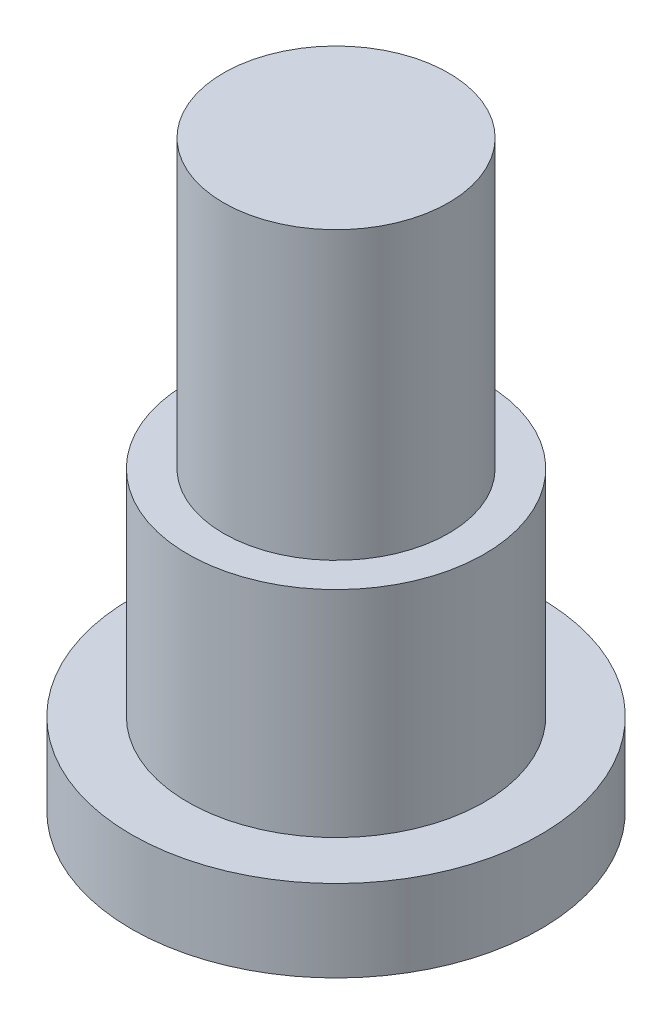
from build123d import *

# Parameters (mm, degrees)
ESQUISSE1_R        = 10
BOSS_EXTRU_1_DEPTH = 4
ESQUISSE3_R        = 7.25
BOSS_EXTRU_2_DEPTH = 10.5
ESQUISSE4_R        = 5.5
BOSS_EXTRU_3_DEPTH = 14


with BuildPart() as part:
    # Esquisse1 → Boss.-Extru.1 (new body)
    with BuildSketch(Plane(origin=(0, 0, 0), x_dir=(1, 0, 0), z_dir=(0, 1, 0))):
        with Locations(Location((0, 0, 0), (0, 0, 270))):
            Circle(ESQUISSE1_R)
    extrude(amount=BOSS_EXTRU_1_DEPTH)

    # Esquisse3 → Boss.-Extru.2 (add)
    with BuildSketch(Plane(origin=(0, 4, 0), x_dir=(1, 0, 0), z_dir=(0, 1, 0))):
        with Locations(Location((0, 0, 0), (0, 0, 90))):
            Circle(ESQUISSE3_R)
    extrude(amount=BOSS_EXTRU_2_DEPTH)

    # Esquisse4 → Boss.-Extru.3 (add)
    with BuildSketch(Plane(origin=(0, 14.5, 0), x_dir=(1, 0, 0), z_dir=(0, 1, 0))):
        with Locations(Location((0, 0, 0), (0, 0, 270))):
            Circle(ESQUISSE4_R)
    extrude(amount=BOSS_EXTRU_3_DEPTH)


solid = part.part
